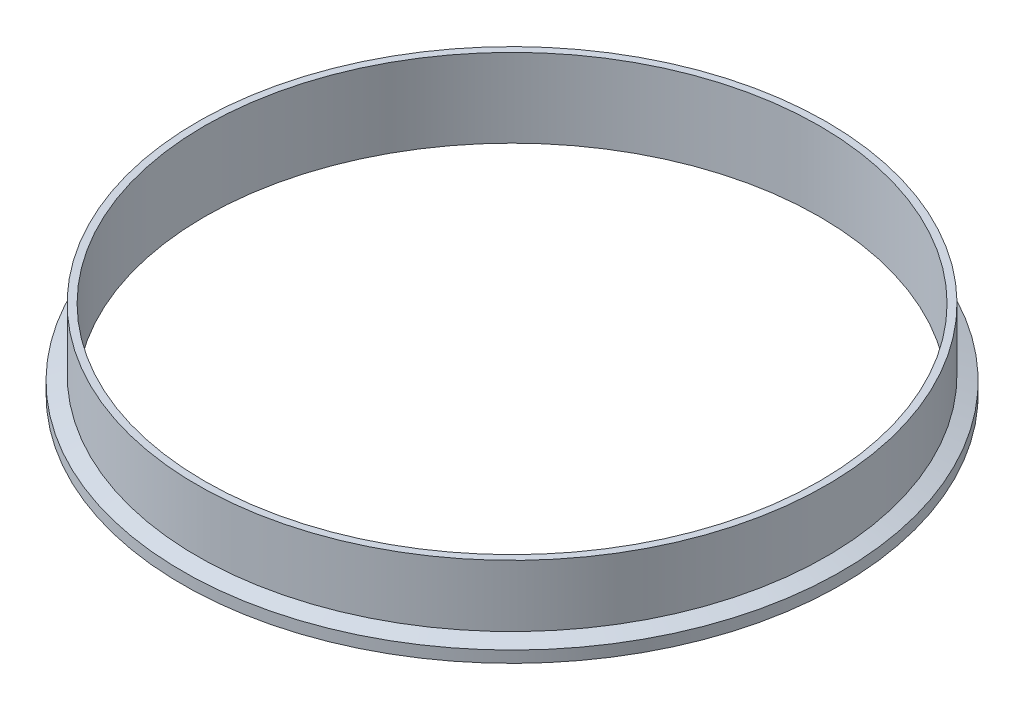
ISO-10303-21;
HEADER;
FILE_DESCRIPTION(('STEP AP214'),'2;1');
FILE_NAME('part.step','',(''),(''),'','','');
FILE_SCHEMA(('AUTOMOTIVE_DESIGN { 1 0 10303 214 1 1 1 1 }'));
ENDSEC;
DATA;
#1=APPLICATION_CONTEXT('core data for automotive mechanical design processes');
#2=APPLICATION_PROTOCOL_DEFINITION('international standard','automotive_design',2000,#1);
#3=PRODUCT_CONTEXT('',#1,'mechanical');
#4=PRODUCT('Part','Part','',(#3));
#5=PRODUCT_RELATED_PRODUCT_CATEGORY('part','',(#4));
#6=PRODUCT_DEFINITION_FORMATION('','',#4);
#7=PRODUCT_DEFINITION_CONTEXT('part definition',#1,'design');
#8=PRODUCT_DEFINITION('design','',#6,#7);
#9=PRODUCT_DEFINITION_SHAPE('','',#8);
#10=(LENGTH_UNIT() NAMED_UNIT(*) SI_UNIT(.MILLI.,.METRE.));
#11=(NAMED_UNIT(*) PLANE_ANGLE_UNIT() SI_UNIT($,.RADIAN.));
#12=(NAMED_UNIT(*) SI_UNIT($,.STERADIAN.) SOLID_ANGLE_UNIT());
#13=UNCERTAINTY_MEASURE_WITH_UNIT(LENGTH_MEASURE(1.E-05),#10,'distance_accuracy_value','');
#14=(GEOMETRIC_REPRESENTATION_CONTEXT(3) GLOBAL_UNCERTAINTY_ASSIGNED_CONTEXT((#13)) GLOBAL_UNIT_ASSIGNED_CONTEXT((#10,
#11,#12)) REPRESENTATION_CONTEXT('',''));
#15=CARTESIAN_POINT('',(0.,0.,0.));
#16=DIRECTION('',(0.,0.,1.));
#17=DIRECTION('',(1.,0.,0.));
#18=AXIS2_PLACEMENT_3D('',#15,#16,#17);
#19=CARTESIAN_POINT('',(0.,0.7874,0.));
#20=DIRECTION('',(0.,-1.,0.));
#21=DIRECTION('',(0.,0.,-1.));
#22=AXIS2_PLACEMENT_3D('',#19,#20,#21);
#23=TOROIDAL_SURFACE('',#22,156.199208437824,0.787400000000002);
#24=CARTESIAN_POINT('',(0.,0.,0.));
#25=DIRECTION('',(0.,-1.,0.));
#26=DIRECTION('',(0.,0.,-1.));
#27=AXIS2_PLACEMENT_3D('',#24,#25,#26);
#28=CIRCLE('',#27,156.199208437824);
#29=CARTESIAN_POINT('',(0.,0.,-156.199208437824));
#30=VERTEX_POINT('',#29);
#31=EDGE_CURVE('E67',#30,#30,#28,.T.);
#32=ORIENTED_EDGE('',*,*,#31,.T.);
#33=EDGE_LOOP('',(#32));
#34=FACE_BOUND('',#33,.T.);
#35=CARTESIAN_POINT('',(0.,0.474458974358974,0.));
#36=DIRECTION('',(0.,-1.,0.));
#37=DIRECTION('',(0.,0.,-1.));
#38=AXIS2_PLACEMENT_3D('',#35,#36,#37);
#39=CIRCLE('',#38,155.476666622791);
#40=CARTESIAN_POINT('',(0.,0.474458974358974,-155.476666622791));
#41=VERTEX_POINT('',#40);
#42=EDGE_CURVE('E10',#41,#41,#39,.T.);
#43=ORIENTED_EDGE('',*,*,#42,.F.);
#44=EDGE_LOOP('',(#43));
#45=FACE_BOUND('',#44,.T.);
#46=ADVANCED_FACE('F33',(#34,#45),#23,.T.);
#47=CARTESIAN_POINT('',(0.,0.,0.));
#48=DIRECTION('',(0.,-1.,0.));
#49=DIRECTION('',(0.,0.,-1.));
#50=AXIS2_PLACEMENT_3D('',#47,#48,#49);
#51=TOROIDAL_SURFACE('',#50,154.3812,1.1938);
#52=CARTESIAN_POINT('',(0.,0.474458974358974,0.));
#53=DIRECTION('',(0.,-1.,0.));
#54=DIRECTION('',(0.,0.,-1.));
#55=AXIS2_PLACEMENT_3D('',#52,#53,#54);
#56=CIRCLE('',#55,153.285733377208);
#57=CARTESIAN_POINT('',(0.,0.474458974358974,-153.285733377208));
#58=VERTEX_POINT('',#57);
#59=EDGE_CURVE('E39',#58,#58,#56,.T.);
#60=ORIENTED_EDGE('',*,*,#59,.F.);
#61=EDGE_LOOP('',(#60));
#62=FACE_BOUND('',#61,.T.);
#63=ORIENTED_EDGE('',*,*,#42,.T.);
#64=EDGE_LOOP('',(#63));
#65=FACE_BOUND('',#64,.T.);
#66=ADVANCED_FACE('F115',(#62,#65),#51,.F.);
#67=CARTESIAN_POINT('',(0.,0.7874,0.));
#68=DIRECTION('',(0.,-1.,0.));
#69=DIRECTION('',(0.,0.,-1.));
#70=AXIS2_PLACEMENT_3D('',#67,#68,#69);
#71=TOROIDAL_SURFACE('',#70,152.563191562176,0.787400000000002);
#72=ORIENTED_EDGE('',*,*,#59,.T.);
#73=EDGE_LOOP('',(#72));
#74=FACE_BOUND('',#73,.T.);
#75=CARTESIAN_POINT('',(0.,0.,0.));
#76=DIRECTION('',(0.,-1.,0.));
#77=DIRECTION('',(0.,0.,-1.));
#78=AXIS2_PLACEMENT_3D('',#75,#76,#77);
#79=CIRCLE('',#78,152.563191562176);
#80=CARTESIAN_POINT('',(0.,0.,-152.563191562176));
#81=VERTEX_POINT('',#80);
#82=EDGE_CURVE('E43',#81,#81,#79,.T.);
#83=ORIENTED_EDGE('',*,*,#82,.F.);
#84=EDGE_LOOP('',(#83));
#85=FACE_BOUND('',#84,.T.);
#86=ADVANCED_FACE('F111',(#74,#85),#71,.T.);
#87=CARTESIAN_POINT('',(0.,0.,0.));
#88=DIRECTION('',(0.,1.,0.));
#89=DIRECTION('',(0.,0.,1.));
#90=AXIS2_PLACEMENT_3D('',#87,#88,#89);
#91=PLANE('',#90);
#92=CARTESIAN_POINT('',(0.,0.,0.));
#93=DIRECTION('',(0.,-1.,0.));
#94=DIRECTION('',(0.,0.,-1.));
#95=AXIS2_PLACEMENT_3D('',#92,#93,#94);
#96=CIRCLE('',#95,148.9964);
#97=CARTESIAN_POINT('',(0.,0.,-148.9964));
#98=VERTEX_POINT('',#97);
#99=EDGE_CURVE('E47',#98,#98,#96,.T.);
#100=ORIENTED_EDGE('',*,*,#99,.F.);
#101=EDGE_LOOP('',(#100));
#102=FACE_BOUND('',#101,.T.);
#103=ORIENTED_EDGE('',*,*,#82,.T.);
#104=EDGE_LOOP('',(#103));
#105=FACE_BOUND('',#104,.T.);
#106=ADVANCED_FACE('F105',(#102,#105),#91,.F.);
#107=CARTESIAN_POINT('',(0.,0.,0.));
#108=DIRECTION('',(0.,-1.,0.));
#109=DIRECTION('',(0.,0.,-1.));
#110=AXIS2_PLACEMENT_3D('',#107,#108,#109);
#111=CYLINDRICAL_SURFACE('',#110,148.9964);
#112=ORIENTED_EDGE('',*,*,#99,.T.);
#113=EDGE_LOOP('',(#112));
#114=FACE_BOUND('',#113,.T.);
#115=CARTESIAN_POINT('',(0.,38.1,0.));
#116=DIRECTION('',(0.,-1.,0.));
#117=DIRECTION('',(0.,0.,-1.));
#118=AXIS2_PLACEMENT_3D('',#115,#116,#117);
#119=CIRCLE('',#118,148.9964);
#120=CARTESIAN_POINT('',(0.,38.1,-148.9964));
#121=VERTEX_POINT('',#120);
#122=EDGE_CURVE('E52',#121,#121,#119,.T.);
#123=ORIENTED_EDGE('',*,*,#122,.F.);
#124=EDGE_LOOP('',(#123));
#125=FACE_BOUND('',#124,.T.);
#126=ADVANCED_FACE('F100',(#114,#125),#111,.F.);
#127=CARTESIAN_POINT('',(0.,38.1,0.));
#128=DIRECTION('',(0.,-1.,0.));
#129=DIRECTION('',(0.,0.,-1.));
#130=AXIS2_PLACEMENT_3D('',#127,#128,#129);
#131=PLANE('',#130);
#132=CARTESIAN_POINT('',(0.,38.1,0.));
#133=DIRECTION('',(0.,-1.,0.));
#134=DIRECTION('',(0.,0.,-1.));
#135=AXIS2_PLACEMENT_3D('',#132,#133,#134);
#136=CIRCLE('',#135,152.4);
#137=CARTESIAN_POINT('',(0.,38.1,-152.4));
#138=VERTEX_POINT('',#137);
#139=EDGE_CURVE('E55',#138,#138,#136,.T.);
#140=ORIENTED_EDGE('',*,*,#139,.F.);
#141=EDGE_LOOP('',(#140));
#142=FACE_BOUND('',#141,.T.);
#143=ORIENTED_EDGE('',*,*,#122,.T.);
#144=EDGE_LOOP('',(#143));
#145=FACE_BOUND('',#144,.T.);
#146=ADVANCED_FACE('F94',(#142,#145),#131,.F.);
#147=CARTESIAN_POINT('',(0.,0.,0.));
#148=DIRECTION('',(0.,-1.,0.));
#149=DIRECTION('',(0.,0.,-1.));
#150=AXIS2_PLACEMENT_3D('',#147,#148,#149);
#151=CYLINDRICAL_SURFACE('',#150,152.4);
#152=CARTESIAN_POINT('',(0.,8.22278052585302,0.));
#153=DIRECTION('',(0.,-1.,0.));
#154=DIRECTION('',(0.,0.,-1.));
#155=AXIS2_PLACEMENT_3D('',#152,#153,#154);
#156=CIRCLE('',#155,152.4);
#157=CARTESIAN_POINT('',(0.,8.22278052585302,-152.4));
#158=VERTEX_POINT('',#157);
#159=EDGE_CURVE('E58',#158,#158,#156,.T.);
#160=ORIENTED_EDGE('',*,*,#159,.F.);
#161=EDGE_LOOP('',(#160));
#162=FACE_BOUND('',#161,.T.);
#163=ORIENTED_EDGE('',*,*,#139,.T.);
#164=EDGE_LOOP('',(#163));
#165=FACE_BOUND('',#164,.T.);
#166=ADVANCED_FACE('F88',(#162,#165),#151,.T.);
#167=CARTESIAN_POINT('',(0.,8.22278052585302,0.));
#168=DIRECTION('',(0.,-1.,0.));
#169=DIRECTION('',(0.,0.,-1.));
#170=AXIS2_PLACEMENT_3D('',#167,#168,#169);
#171=CONICAL_SURFACE('',#170,152.4,1.22173047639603);
#172=CARTESIAN_POINT('',(0.,5.58799999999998,0.));
#173=DIRECTION('',(0.,-1.,0.));
#174=DIRECTION('',(0.,0.,-1.));
#175=AXIS2_PLACEMENT_3D('',#172,#173,#174);
#176=CIRCLE('',#175,159.639);
#177=CARTESIAN_POINT('',(0.,5.58799999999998,-159.639));
#178=VERTEX_POINT('',#177);
#179=EDGE_CURVE('E61',#178,#178,#176,.T.);
#180=ORIENTED_EDGE('',*,*,#179,.F.);
#181=EDGE_LOOP('',(#180));
#182=FACE_BOUND('',#181,.T.);
#183=ORIENTED_EDGE('',*,*,#159,.T.);
#184=EDGE_LOOP('',(#183));
#185=FACE_BOUND('',#184,.T.);
#186=ADVANCED_FACE('F82',(#182,#185),#171,.T.);
#187=CARTESIAN_POINT('',(0.,0.,0.));
#188=DIRECTION('',(0.,-1.,0.));
#189=DIRECTION('',(0.,0.,-1.));
#190=AXIS2_PLACEMENT_3D('',#187,#188,#189);
#191=CYLINDRICAL_SURFACE('',#190,159.639);
#192=CARTESIAN_POINT('',(0.,0.,0.));
#193=DIRECTION('',(0.,-1.,0.));
#194=DIRECTION('',(0.,0.,-1.));
#195=AXIS2_PLACEMENT_3D('',#192,#193,#194);
#196=CIRCLE('',#195,159.639);
#197=CARTESIAN_POINT('',(0.,0.,-159.639));
#198=VERTEX_POINT('',#197);
#199=EDGE_CURVE('E64',#198,#198,#196,.T.);
#200=ORIENTED_EDGE('',*,*,#199,.F.);
#201=EDGE_LOOP('',(#200));
#202=FACE_BOUND('',#201,.T.);
#203=ORIENTED_EDGE('',*,*,#179,.T.);
#204=EDGE_LOOP('',(#203));
#205=FACE_BOUND('',#204,.T.);
#206=ADVANCED_FACE('F76',(#202,#205),#191,.T.);
#207=CARTESIAN_POINT('',(0.,0.,0.));
#208=DIRECTION('',(0.,1.,0.));
#209=DIRECTION('',(0.,0.,1.));
#210=AXIS2_PLACEMENT_3D('',#207,#208,#209);
#211=PLANE('',#210);
#212=ORIENTED_EDGE('',*,*,#31,.F.);
#213=EDGE_LOOP('',(#212));
#214=FACE_BOUND('',#213,.T.);
#215=ORIENTED_EDGE('',*,*,#199,.T.);
#216=EDGE_LOOP('',(#215));
#217=FACE_BOUND('',#216,.T.);
#218=ADVANCED_FACE('F73',(#214,#217),#211,.F.);
#219=CLOSED_SHELL('',(#46,#66,#86,#106,#126,#146,#166,#186,#206,#218));
#220=MANIFOLD_SOLID_BREP('B2',#219);
#221=ADVANCED_BREP_SHAPE_REPRESENTATION('',(#18,#220),#14);
#222=SHAPE_DEFINITION_REPRESENTATION(#9,#221);
ENDSEC;
END-ISO-10303-21;
